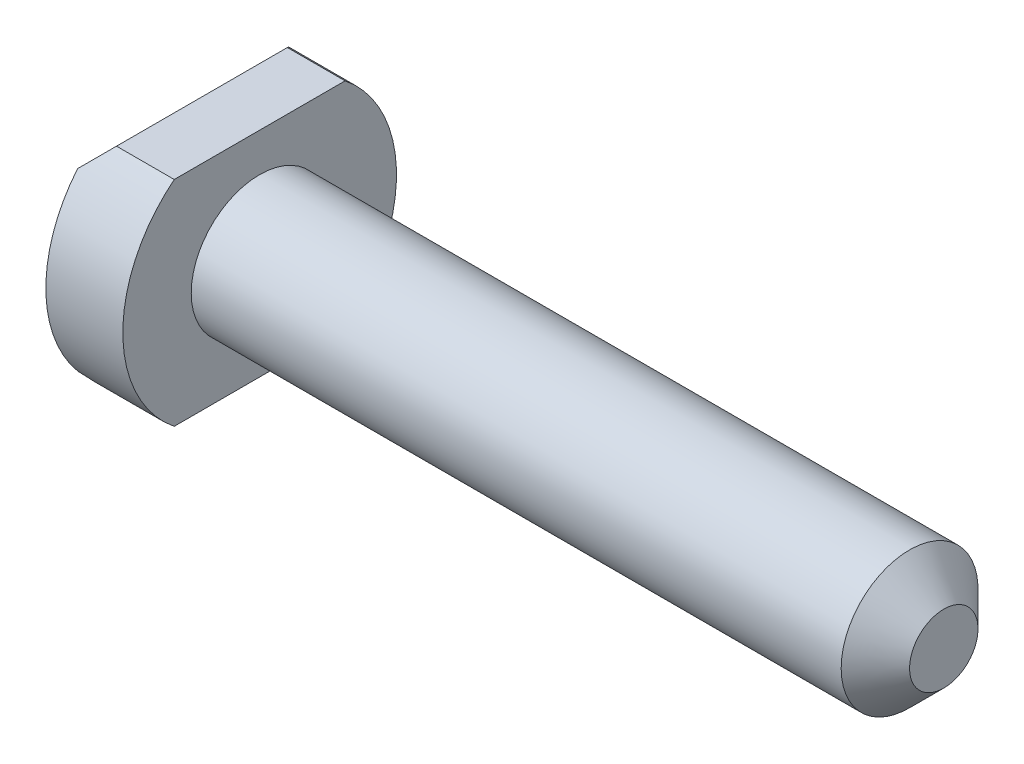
ISO-10303-21;
HEADER;
FILE_DESCRIPTION(('STEP AP214'),'2;1');
FILE_NAME('part.step','',(''),(''),'','','');
FILE_SCHEMA(('AUTOMOTIVE_DESIGN { 1 0 10303 214 1 1 1 1 }'));
ENDSEC;
DATA;
#1=APPLICATION_CONTEXT('core data for automotive mechanical design processes');
#2=APPLICATION_PROTOCOL_DEFINITION('international standard','automotive_design',2000,#1);
#3=PRODUCT_CONTEXT('',#1,'mechanical');
#4=PRODUCT('Part','Part','',(#3));
#5=PRODUCT_RELATED_PRODUCT_CATEGORY('part','',(#4));
#6=PRODUCT_DEFINITION_FORMATION('','',#4);
#7=PRODUCT_DEFINITION_CONTEXT('part definition',#1,'design');
#8=PRODUCT_DEFINITION('design','',#6,#7);
#9=PRODUCT_DEFINITION_SHAPE('','',#8);
#10=(LENGTH_UNIT() NAMED_UNIT(*) SI_UNIT(.MILLI.,.METRE.));
#11=(NAMED_UNIT(*) PLANE_ANGLE_UNIT() SI_UNIT($,.RADIAN.));
#12=(NAMED_UNIT(*) SI_UNIT($,.STERADIAN.) SOLID_ANGLE_UNIT());
#13=UNCERTAINTY_MEASURE_WITH_UNIT(LENGTH_MEASURE(1.E-05),#10,'distance_accuracy_value','');
#14=(GEOMETRIC_REPRESENTATION_CONTEXT(3) GLOBAL_UNCERTAINTY_ASSIGNED_CONTEXT((#13)) GLOBAL_UNIT_ASSIGNED_CONTEXT((#10,
#11,#12)) REPRESENTATION_CONTEXT('',''));
#15=CARTESIAN_POINT('',(0.,0.,0.));
#16=DIRECTION('',(0.,0.,1.));
#17=DIRECTION('',(1.,0.,0.));
#18=AXIS2_PLACEMENT_3D('',#15,#16,#17);
#19=CARTESIAN_POINT('',(9.,0.,0.));
#20=DIRECTION('',(1.,0.,0.));
#21=DIRECTION('',(0.,0.,-1.));
#22=AXIS2_PLACEMENT_3D('',#19,#20,#21);
#23=PLANE('',#22);
#24=CARTESIAN_POINT('',(9.,0.,0.));
#25=DIRECTION('',(1.,0.,0.));
#26=DIRECTION('',(0.,0.,-1.));
#27=AXIS2_PLACEMENT_3D('',#24,#25,#26);
#28=CIRCLE('',#27,16.);
#29=CARTESIAN_POINT('',(9.,12.5,9.98749217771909));
#30=VERTEX_POINT('',#29);
#31=CARTESIAN_POINT('',(9.,-12.5,9.98749217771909));
#32=VERTEX_POINT('',#31);
#33=EDGE_CURVE('E106',#30,#32,#28,.T.);
#34=ORIENTED_EDGE('',*,*,#33,.T.);
#35=DIRECTION('',(0.,0.,-1.));
#36=VECTOR('',#35,1.);
#37=CARTESIAN_POINT('',(9.,-12.5,9.98749217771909));
#38=LINE('',#37,#36);
#39=CARTESIAN_POINT('',(9.,-12.5,-9.98749217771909));
#40=VERTEX_POINT('',#39);
#41=EDGE_CURVE('E94',#32,#40,#38,.T.);
#42=ORIENTED_EDGE('',*,*,#41,.T.);
#43=CARTESIAN_POINT('',(9.,0.,0.));
#44=DIRECTION('',(1.,0.,0.));
#45=DIRECTION('',(0.,0.,-1.));
#46=AXIS2_PLACEMENT_3D('',#43,#44,#45);
#47=CIRCLE('',#46,16.);
#48=CARTESIAN_POINT('',(9.,12.5,-9.98749217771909));
#49=VERTEX_POINT('',#48);
#50=EDGE_CURVE('E105',#40,#49,#47,.T.);
#51=ORIENTED_EDGE('',*,*,#50,.T.);
#52=DIRECTION('',(0.,0.,1.));
#53=VECTOR('',#52,1.);
#54=CARTESIAN_POINT('',(9.,12.5,9.98749217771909));
#55=LINE('',#54,#53);
#56=EDGE_CURVE('E111',#49,#30,#55,.T.);
#57=ORIENTED_EDGE('',*,*,#56,.T.);
#58=EDGE_LOOP('',(#34,#42,#51,#57));
#59=FACE_BOUND('',#58,.T.);
#60=CARTESIAN_POINT('',(9.,0.,0.));
#61=DIRECTION('',(1.,0.,0.));
#62=DIRECTION('',(0.,0.,-1.));
#63=AXIS2_PLACEMENT_3D('',#60,#61,#62);
#64=CIRCLE('',#63,8.);
#65=CARTESIAN_POINT('',(9.,0.,-8.));
#66=VERTEX_POINT('',#65);
#67=EDGE_CURVE('E137',#66,#66,#64,.F.);
#68=ORIENTED_EDGE('',*,*,#67,.T.);
#69=EDGE_LOOP('',(#68));
#70=FACE_BOUND('',#69,.T.);
#71=ADVANCED_FACE('F39',(#59,#70),#23,.T.);
#72=CARTESIAN_POINT('',(9.,0.,0.));
#73=DIRECTION('',(-1.,0.,0.));
#74=DIRECTION('',(0.,0.,1.));
#75=AXIS2_PLACEMENT_3D('',#72,#73,#74);
#76=CYLINDRICAL_SURFACE('',#75,16.);
#77=CARTESIAN_POINT('',(0.,0.,0.));
#78=DIRECTION('',(1.,0.,0.));
#79=DIRECTION('',(0.,0.,-1.));
#80=AXIS2_PLACEMENT_3D('',#77,#78,#79);
#81=CIRCLE('',#80,16.);
#82=CARTESIAN_POINT('',(0.,10.25,12.2856623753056));
#83=VERTEX_POINT('',#82);
#84=CARTESIAN_POINT('',(0.,-10.25,12.2856623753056));
#85=VERTEX_POINT('',#84);
#86=EDGE_CURVE('E133',#83,#85,#81,.T.);
#87=ORIENTED_EDGE('',*,*,#86,.T.);
#88=CARTESIAN_POINT('',(-10.2499999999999,0.,0.));
#89=DIRECTION('',(0.707106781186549,0.707106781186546,0.));
#90=DIRECTION('',(-0.707106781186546,0.707106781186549,0.));
#91=AXIS2_PLACEMENT_3D('',#88,#89,#90);
#92=ELLIPSE('',#91,22.6274169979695,16.);
#93=CARTESIAN_POINT('',(2.25,-12.5,9.98749217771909));
#94=VERTEX_POINT('',#93);
#95=EDGE_CURVE('E47',#85,#94,#92,.T.);
#96=ORIENTED_EDGE('',*,*,#95,.T.);
#97=DIRECTION('',(-1.,0.,0.));
#98=VECTOR('',#97,1.);
#99=CARTESIAN_POINT('',(9.,-12.5,9.98749217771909));
#100=LINE('',#99,#98);
#101=EDGE_CURVE('E99',#32,#94,#100,.T.);
#102=ORIENTED_EDGE('',*,*,#101,.F.);
#103=ORIENTED_EDGE('',*,*,#33,.F.);
#104=DIRECTION('',(-1.,0.,0.));
#105=VECTOR('',#104,1.);
#106=CARTESIAN_POINT('',(9.,12.5,9.98749217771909));
#107=LINE('',#106,#105);
#108=CARTESIAN_POINT('',(2.25,12.5,9.98749217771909));
#109=VERTEX_POINT('',#108);
#110=EDGE_CURVE('E134',#30,#109,#107,.T.);
#111=ORIENTED_EDGE('',*,*,#110,.T.);
#112=CARTESIAN_POINT('',(-10.2499999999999,0.,0.));
#113=DIRECTION('',(0.707106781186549,-0.707106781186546,0.));
#114=DIRECTION('',(-0.707106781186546,-0.707106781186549,0.));
#115=AXIS2_PLACEMENT_3D('',#112,#113,#114);
#116=ELLIPSE('',#115,22.6274169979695,16.);
#117=EDGE_CURVE('E54',#109,#83,#116,.T.);
#118=ORIENTED_EDGE('',*,*,#117,.T.);
#119=EDGE_LOOP('',(#87,#96,#102,#103,#111,#118));
#120=FACE_BOUND('',#119,.T.);
#121=ADVANCED_FACE('F117',(#120),#76,.T.);
#122=CARTESIAN_POINT('',(9.,-12.5,9.98749217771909));
#123=DIRECTION('',(0.,1.,0.));
#124=DIRECTION('',(0.,0.,1.));
#125=AXIS2_PLACEMENT_3D('',#122,#123,#124);
#126=PLANE('',#125);
#127=ORIENTED_EDGE('',*,*,#101,.T.);
#128=DIRECTION('',(0.,0.,-1.));
#129=VECTOR('',#128,1.);
#130=CARTESIAN_POINT('',(2.25,-12.5,9.98749217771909));
#131=LINE('',#130,#129);
#132=CARTESIAN_POINT('',(2.25,-12.5,-9.98749217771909));
#133=VERTEX_POINT('',#132);
#134=EDGE_CURVE('E119',#94,#133,#131,.T.);
#135=ORIENTED_EDGE('',*,*,#134,.T.);
#136=DIRECTION('',(-1.,0.,0.));
#137=VECTOR('',#136,1.);
#138=CARTESIAN_POINT('',(9.,-12.5,-9.98749217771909));
#139=LINE('',#138,#137);
#140=EDGE_CURVE('E102',#40,#133,#139,.T.);
#141=ORIENTED_EDGE('',*,*,#140,.F.);
#142=ORIENTED_EDGE('',*,*,#41,.F.);
#143=EDGE_LOOP('',(#127,#135,#141,#142));
#144=FACE_BOUND('',#143,.T.);
#145=ADVANCED_FACE('F96',(#144),#126,.F.);
#146=CARTESIAN_POINT('',(9.,0.,0.));
#147=DIRECTION('',(-1.,0.,0.));
#148=DIRECTION('',(0.,0.,1.));
#149=AXIS2_PLACEMENT_3D('',#146,#147,#148);
#150=CYLINDRICAL_SURFACE('',#149,16.);
#151=ORIENTED_EDGE('',*,*,#140,.T.);
#152=CARTESIAN_POINT('',(-10.2499999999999,0.,0.));
#153=DIRECTION('',(0.707106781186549,0.707106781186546,0.));
#154=DIRECTION('',(-0.707106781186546,0.707106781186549,0.));
#155=AXIS2_PLACEMENT_3D('',#152,#153,#154);
#156=ELLIPSE('',#155,22.6274169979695,16.);
#157=CARTESIAN_POINT('',(0.,-10.25,-12.2856623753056));
#158=VERTEX_POINT('',#157);
#159=EDGE_CURVE('E128',#133,#158,#156,.T.);
#160=ORIENTED_EDGE('',*,*,#159,.T.);
#161=CARTESIAN_POINT('',(0.,0.,0.));
#162=DIRECTION('',(1.,0.,0.));
#163=DIRECTION('',(0.,0.,-1.));
#164=AXIS2_PLACEMENT_3D('',#161,#162,#163);
#165=CIRCLE('',#164,16.);
#166=CARTESIAN_POINT('',(0.,10.25,-12.2856623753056));
#167=VERTEX_POINT('',#166);
#168=EDGE_CURVE('E115',#158,#167,#165,.T.);
#169=ORIENTED_EDGE('',*,*,#168,.T.);
#170=CARTESIAN_POINT('',(-10.2499999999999,0.,0.));
#171=DIRECTION('',(0.707106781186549,-0.707106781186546,0.));
#172=DIRECTION('',(-0.707106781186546,-0.707106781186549,0.));
#173=AXIS2_PLACEMENT_3D('',#170,#171,#172);
#174=ELLIPSE('',#173,22.6274169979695,16.);
#175=CARTESIAN_POINT('',(2.25,12.5,-9.98749217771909));
#176=VERTEX_POINT('',#175);
#177=EDGE_CURVE('E121',#167,#176,#174,.T.);
#178=ORIENTED_EDGE('',*,*,#177,.T.);
#179=DIRECTION('',(-1.,0.,0.));
#180=VECTOR('',#179,1.);
#181=CARTESIAN_POINT('',(9.,12.5,-9.98749217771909));
#182=LINE('',#181,#180);
#183=EDGE_CURVE('E123',#49,#176,#182,.T.);
#184=ORIENTED_EDGE('',*,*,#183,.F.);
#185=ORIENTED_EDGE('',*,*,#50,.F.);
#186=EDGE_LOOP('',(#151,#160,#169,#178,#184,#185));
#187=FACE_BOUND('',#186,.T.);
#188=ADVANCED_FACE('F143',(#187),#150,.T.);
#189=CARTESIAN_POINT('',(9.,12.5,9.98749217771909));
#190=DIRECTION('',(0.,-1.,0.));
#191=DIRECTION('',(0.,0.,-1.));
#192=AXIS2_PLACEMENT_3D('',#189,#190,#191);
#193=PLANE('',#192);
#194=ORIENTED_EDGE('',*,*,#183,.T.);
#195=DIRECTION('',(0.,0.,1.));
#196=VECTOR('',#195,1.);
#197=CARTESIAN_POINT('',(2.25,12.5,9.98749217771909));
#198=LINE('',#197,#196);
#199=EDGE_CURVE('E11',#176,#109,#198,.T.);
#200=ORIENTED_EDGE('',*,*,#199,.T.);
#201=ORIENTED_EDGE('',*,*,#110,.F.);
#202=ORIENTED_EDGE('',*,*,#56,.F.);
#203=EDGE_LOOP('',(#194,#200,#201,#202));
#204=FACE_BOUND('',#203,.T.);
#205=ADVANCED_FACE('F145',(#204),#193,.F.);
#206=CARTESIAN_POINT('',(0.,0.,0.));
#207=DIRECTION('',(1.,0.,0.));
#208=DIRECTION('',(0.,0.,-1.));
#209=AXIS2_PLACEMENT_3D('',#206,#207,#208);
#210=PLANE('',#209);
#211=ORIENTED_EDGE('',*,*,#168,.F.);
#212=DIRECTION('',(0.,0.,1.));
#213=VECTOR('',#212,1.);
#214=CARTESIAN_POINT('',(0.,-10.25,0.));
#215=LINE('',#214,#213);
#216=EDGE_CURVE('E61',#158,#85,#215,.T.);
#217=ORIENTED_EDGE('',*,*,#216,.T.);
#218=ORIENTED_EDGE('',*,*,#86,.F.);
#219=DIRECTION('',(0.,0.,-1.));
#220=VECTOR('',#219,1.);
#221=CARTESIAN_POINT('',(0.,10.25,0.));
#222=LINE('',#221,#220);
#223=EDGE_CURVE('E130',#83,#167,#222,.T.);
#224=ORIENTED_EDGE('',*,*,#223,.T.);
#225=EDGE_LOOP('',(#211,#217,#218,#224));
#226=FACE_BOUND('',#225,.T.);
#227=ADVANCED_FACE('F135',(#226),#210,.F.);
#228=CARTESIAN_POINT('',(2.25,-12.5,9.98749217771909));
#229=DIRECTION('',(0.707106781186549,0.707106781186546,0.));
#230=DIRECTION('',(-0.707106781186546,0.707106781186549,0.));
#231=AXIS2_PLACEMENT_3D('',#228,#229,#230);
#232=PLANE('',#231);
#233=ORIENTED_EDGE('',*,*,#95,.F.);
#234=ORIENTED_EDGE('',*,*,#216,.F.);
#235=ORIENTED_EDGE('',*,*,#159,.F.);
#236=ORIENTED_EDGE('',*,*,#134,.F.);
#237=EDGE_LOOP('',(#233,#234,#235,#236));
#238=FACE_BOUND('',#237,.T.);
#239=ADVANCED_FACE('F183',(#238),#232,.F.);
#240=CARTESIAN_POINT('',(2.25,12.5,9.98749217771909));
#241=DIRECTION('',(0.707106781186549,-0.707106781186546,0.));
#242=DIRECTION('',(0.707106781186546,0.707106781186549,0.));
#243=AXIS2_PLACEMENT_3D('',#240,#241,#242);
#244=PLANE('',#243);
#245=ORIENTED_EDGE('',*,*,#177,.F.);
#246=ORIENTED_EDGE('',*,*,#223,.F.);
#247=ORIENTED_EDGE('',*,*,#117,.F.);
#248=ORIENTED_EDGE('',*,*,#199,.F.);
#249=EDGE_LOOP('',(#245,#246,#247,#248));
#250=FACE_BOUND('',#249,.T.);
#251=ADVANCED_FACE('F41',(#250),#244,.F.);
#252=CARTESIAN_POINT('',(0.,0.,0.));
#253=DIRECTION('',(-1.,0.,0.));
#254=DIRECTION('',(0.,0.,1.));
#255=AXIS2_PLACEMENT_3D('',#252,#253,#254);
#256=CYLINDRICAL_SURFACE('',#255,8.);
#257=ORIENTED_EDGE('',*,*,#67,.F.);
#258=EDGE_LOOP('',(#257));
#259=FACE_BOUND('',#258,.T.);
#260=CARTESIAN_POINT('',(85.,0.,0.));
#261=DIRECTION('',(-1.,0.,0.));
#262=DIRECTION('',(0.,0.,1.));
#263=AXIS2_PLACEMENT_3D('',#260,#261,#262);
#264=CIRCLE('',#263,8.);
#265=CARTESIAN_POINT('',(85.,0.,8.));
#266=VERTEX_POINT('',#265);
#267=EDGE_CURVE('E153',#266,#266,#264,.T.);
#268=ORIENTED_EDGE('',*,*,#267,.T.);
#269=EDGE_LOOP('',(#268));
#270=FACE_BOUND('',#269,.T.);
#271=ADVANCED_FACE('F169',(#259,#270),#256,.T.);
#272=CARTESIAN_POINT('',(89.,0.,0.));
#273=DIRECTION('',(-1.,0.,0.));
#274=DIRECTION('',(0.,0.,1.));
#275=AXIS2_PLACEMENT_3D('',#272,#273,#274);
#276=CONICAL_SURFACE('',#275,3.99999999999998,0.78539816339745);
#277=ORIENTED_EDGE('',*,*,#267,.F.);
#278=EDGE_LOOP('',(#277));
#279=FACE_BOUND('',#278,.T.);
#280=CARTESIAN_POINT('',(89.,0.,0.));
#281=DIRECTION('',(-1.,0.,0.));
#282=DIRECTION('',(0.,0.,1.));
#283=AXIS2_PLACEMENT_3D('',#280,#281,#282);
#284=CIRCLE('',#283,3.99999999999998);
#285=CARTESIAN_POINT('',(89.,0.,3.99999999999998));
#286=VERTEX_POINT('',#285);
#287=EDGE_CURVE('E156',#286,#286,#284,.T.);
#288=ORIENTED_EDGE('',*,*,#287,.T.);
#289=EDGE_LOOP('',(#288));
#290=FACE_BOUND('',#289,.T.);
#291=ADVANCED_FACE('F160',(#279,#290),#276,.T.);
#292=CARTESIAN_POINT('',(89.,0.,0.));
#293=DIRECTION('',(-1.,0.,0.));
#294=DIRECTION('',(0.,0.,1.));
#295=AXIS2_PLACEMENT_3D('',#292,#293,#294);
#296=PLANE('',#295);
#297=ORIENTED_EDGE('',*,*,#287,.F.);
#298=EDGE_LOOP('',(#297));
#299=FACE_BOUND('',#298,.T.);
#300=ADVANCED_FACE('F162',(#299),#296,.F.);
#301=CLOSED_SHELL('',(#71,#121,#145,#188,#205,#227,#239,#251,#271,#291,#300));
#302=MANIFOLD_SOLID_BREP('B2',#301);
#303=ADVANCED_BREP_SHAPE_REPRESENTATION('',(#18,#302),#14);
#304=SHAPE_DEFINITION_REPRESENTATION(#9,#303);
ENDSEC;
END-ISO-10303-21;
